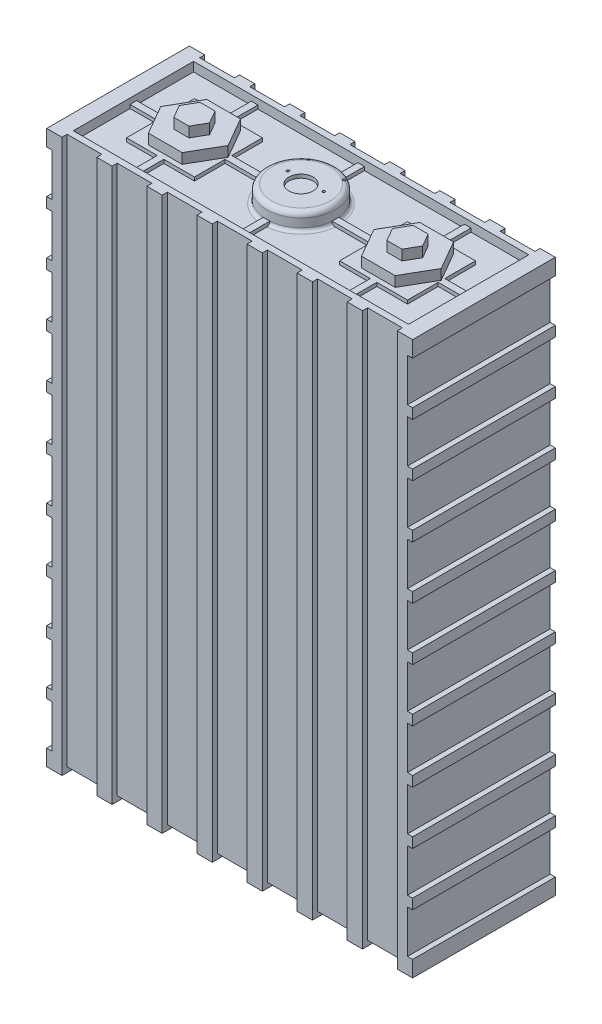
from build123d import *

# Parameters (mm, degrees)
SKETCH1_W           = 182
SKETCH1_H           = 275
BOSS_EXTRUDE1_DEPTH = 71
SKETCH2_W           = 71
SKETCH2_H           = 21.328
CUT_EXTRUDE1_DEPTH  = 2.54
SKETCH3_W           = 17.291428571
SKETCH3_H           = 275
SKETCH3_W_2         = 17.291428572
CUT_EXTRUDE2_DEPTH  = 2.54
SKETCH5_W           = 17.291428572
SKETCH5_H           = 65.92
SKETCH5_W_2         = 17.291428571
CUT_EXTRUDE3_DEPTH  = 2.54
SKETCH7_W           = 166.76
SKETCH7_H           = 59.824
CUT_EXTRUDE4_DEPTH  = 4.572
BOSS_EXTRUDE5_DEPTH = 1.778
SKETCH10_R          = 17.145
BOSS_EXTRUDE6_DEPTH = 8.382
FILLET2_R           = 2.54
FILLET4_R           = 1.6256
SKETCH11_R          = 6.023369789
CUT_EXTRUDE5_DEPTH  = 1.778
SKETCH12_R          = 0.648251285
CUT_EXTRUDE6_DEPTH  = 1.27
BOSS_EXTRUDE7_DEPTH = 5.08
BOSS_EXTRUDE8_DEPTH = 5.08


with BuildPart() as part:
    # Sketch1 → Boss-Extrude1 (new body)
    with BuildSketch(Plane.XY):
        with Locations((-91, 137.5)):
            Rectangle(SKETCH1_W, SKETCH1_H)
    extrude(amount=BOSS_EXTRUDE1_DEPTH)

    # Sketch2 → Cut-Extrude1 (cut)
    with BuildSketch(Plane.ZY.offset(182)):
        with Locations((35.5, 256.336)):
            Rectangle(SKETCH2_W, SKETCH2_H)
        with Locations((35.5, 229.928)):
            Rectangle(SKETCH2_W, SKETCH2_H)
        with Locations((35.5, 203.52)):
            Rectangle(SKETCH2_W, SKETCH2_H)
        with Locations((35.5, 177.112)):
            Rectangle(SKETCH2_W, SKETCH2_H)
        with Locations((35.5, 150.704)):
            Rectangle(SKETCH2_W, SKETCH2_H)
        with Locations((35.5, 124.296)):
            Rectangle(SKETCH2_W, SKETCH2_H)
        with Locations((35.5, 97.888)):
            Rectangle(SKETCH2_W, SKETCH2_H)
        with Locations((35.5, 71.48)):
            Rectangle(SKETCH2_W, SKETCH2_H)
        with Locations((35.5, 45.072)):
            Rectangle(SKETCH2_W, SKETCH2_H)
        with Locations((35.5, 18.664)):
            Rectangle(SKETCH2_W, SKETCH2_H)
    cut_extrude1 = extrude(amount=-CUT_EXTRUDE1_DEPTH, mode=Mode.SUBTRACT)

    # Mirror1: Cut-Extrude1 across plane
    add(cut_extrude1.mirror(Plane(origin=(-91, 0, 0), x_dir=(0, 0, 1), z_dir=(1, 0, 0))), mode=Mode.SUBTRACT)

    # Sketch3 → Cut-Extrude2 (cut)
    with BuildSketch(Plane.XY.offset(71)):
        with Locations((-165.734285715, 137.5)):
            Rectangle(SKETCH3_W, SKETCH3_H)
        with Locations((-140.822857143, 137.5)):
            Rectangle(SKETCH3_W_2, SKETCH3_H)
        with Locations((-115.911428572, 137.5)):
            Rectangle(SKETCH3_W, SKETCH3_H)
        with Locations((-91, 137.5)):
            Rectangle(SKETCH3_W_2, SKETCH3_H)
        with Locations((-66.088571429, 137.5)):
            Rectangle(SKETCH3_W, SKETCH3_H)
        with Locations((-41.177142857, 137.5)):
            Rectangle(SKETCH3_W_2, SKETCH3_H)
        with Locations((-16.265714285, 137.5)):
            Rectangle(SKETCH3_W, SKETCH3_H)
    cut_extrude2 = extrude(amount=-CUT_EXTRUDE2_DEPTH, mode=Mode.SUBTRACT)

    # Mirror2: Cut-Extrude2 across plane
    add(cut_extrude2.mirror(Plane.XY.offset(35.5)), mode=Mode.SUBTRACT)

    # Sketch5 → Cut-Extrude3 (cut)
    with BuildSketch(Plane.XZ):
        with Locations((-140.822857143, 35.5)):
            Rectangle(SKETCH5_W, SKETCH5_H)
        with Locations((-165.734285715, 35.5)):
            Rectangle(SKETCH5_W_2, SKETCH5_H)
        with Locations((-115.911428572, 35.5)):
            Rectangle(SKETCH5_W_2, SKETCH5_H)
        with Locations((-91, 35.5)):
            Rectangle(SKETCH5_W, SKETCH5_H)
        with Locations((-66.088571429, 35.5)):
            Rectangle(SKETCH5_W_2, SKETCH5_H)
        with Locations((-41.177142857, 35.5)):
            Rectangle(SKETCH5_W, SKETCH5_H)
        with Locations((-16.265714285, 35.5)):
            Rectangle(SKETCH5_W_2, SKETCH5_H)
    extrude(amount=-CUT_EXTRUDE3_DEPTH, mode=Mode.SUBTRACT)

    # Sketch7 → Cut-Extrude4 (cut)
    with BuildSketch(Plane(origin=(0, 275, 0), x_dir=(1, 0, 0), z_dir=(0, 1, 0))):
        with Locations((-91, -35.5)):
            Rectangle(SKETCH7_W, SKETCH7_H)
    extrude(amount=-CUT_EXTRUDE4_DEPTH, mode=Mode.SUBTRACT)

    # Sketch8 → Boss-Extrude5 (add)
    with BuildSketch(Plane(origin=(0, 270.428, 0), x_dir=(1, 0, 0), z_dir=(0, 1, 0))):
        Polygon((-142.349, -18.609), (-127.109, -18.609), (-127.109, -33.849), (-92.651, -33.849), (-92.651, -5.588), (-89.349, -5.588), (-89.349, -33.849), (-54.891, -33.849), (-54.891, -18.609), (-39.651, -18.609), (-39.651, -5.588), (-36.349, -5.588), (-36.349, -18.609), (-21.109, -18.609), (-21.109, -33.849), (-7.62, -33.849), (-7.62, -37.151), (-21.109, -37.151), (-21.109, -52.391), (-36.349, -52.391), (-36.349, -65.412), (-39.651, -65.412), (-39.651, -52.391), (-54.891, -52.391), (-54.891, -37.151), (-89.349, -37.151), (-89.349, -65.412), (-92.651, -65.412), (-92.651, -37.151), (-127.109, -37.151), (-127.109, -52.391), (-142.349, -52.391), (-142.349, -65.412), (-145.651, -65.412), (-145.651, -52.391), (-160.891, -52.391), (-160.891, -37.151), (-174.38, -37.151), (-174.38, -33.849), (-160.891, -33.849), (-160.891, -18.609), (-145.651, -18.609), (-145.651, -5.588), (-142.349, -5.588), align=None)
    extrude(amount=BOSS_EXTRUDE5_DEPTH)

    # Sketch10 → Boss-Extrude6 (add)
    with BuildSketch(Plane(origin=(0, 270.428, 0), x_dir=(-1, 0, 0), z_dir=(0, 1, 0))):
        with Locations(Location((91, 35.5, 0), (0, 0, 264.474065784))):
            Circle(SKETCH10_R)
    extrude(amount=BOSS_EXTRUDE6_DEPTH)

    # Fillet2
    fillet2_edges = [part.edges().sort_by_distance(p)[0] for p in [
        (-92.651, 278.81, 52.565322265),
    ]]
    fillet(fillet2_edges, radius=FILLET2_R)

    # Fillet4
    fillet4_edges = [part.edges().sort_by_distance(p)[0] for p in [
        (-103.123345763, 270.428, 47.623345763),
        (-78.876654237, 270.428, 47.623345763),
        (-78.876654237, 270.428, 23.376654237),
        (-103.123345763, 270.428, 23.376654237),
    ]]
    fillet(fillet4_edges, radius=FILLET4_R)

    # Sketch11 → Cut-Extrude5 (cut)
    with BuildSketch(Plane(origin=(0, 278.81, 0), x_dir=(1, 0, 0), z_dir=(0, 1, 0))):
        with Locations(Location((-91, -35.5, 0), (0, 0, 270))):
            Circle(SKETCH11_R)
    extrude(amount=-CUT_EXTRUDE5_DEPTH, mode=Mode.SUBTRACT)

    # Sketch12 → Cut-Extrude6 (cut)
    with BuildSketch(Plane(origin=(0, 278.81, 0), x_dir=(1, 0, 0), z_dir=(0, 1, 0))):
        with Locations((-91, -38.230173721)):
            Circle(SKETCH12_R)
        with Locations(Location((-99.859590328, -33.115086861, 0), (0, 0, 270))):
            Circle(SKETCH12_R)
        with Locations(Location((-99.859590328, -22.884913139, 0), (0, 0, 270))):
            Circle(SKETCH12_R)
        with Locations((-91, -17.769826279)):
            Circle(SKETCH12_R)
        with Locations(Location((-82.140409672, -22.884913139, 0), (0, 0, 270))):
            Circle(SKETCH12_R)
        with Locations(Location((-82.140409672, -33.115086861, 0), (0, 0, 270))):
            Circle(SKETCH12_R)
    extrude(amount=-CUT_EXTRUDE6_DEPTH, mode=Mode.SUBTRACT)

    # Sketch13 → Boss-Extrude7 (add)
    with BuildSketch(Plane(origin=(0, 272.206, 0), x_dir=(1, 0, 0), z_dir=(0, 1, 0))):
        Polygon((-127.236, -35.5), (-135.618, -20.981950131), (-152.382, -20.981950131), (-160.764, -35.5), (-152.382, -50.018049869), (-135.618, -50.018049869), align=None)
        Polygon((-21.236, -35.5), (-29.618, -20.981950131), (-46.382, -20.981950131), (-54.764, -35.5), (-46.382, -50.018049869), (-29.618, -50.018049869), align=None)
    extrude(amount=BOSS_EXTRUDE7_DEPTH)

    # Sketch14 → Boss-Extrude8 (add)
    with BuildSketch(Plane(origin=(0, 277.286, 0), x_dir=(1, 0, 0), z_dir=(0, 1, 0))):
        Polygon((-136.494446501, -35.5), (-140.24722325, -29), (-147.75277675, -29), (-151.505553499, -35.5), (-147.75277675, -42), (-140.24722325, -42), align=None)
        Polygon((-30.494446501, -35.5), (-34.24722325, -29), (-41.75277675, -29), (-45.505553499, -35.5), (-41.75277675, -42), (-34.24722325, -42), align=None)
    extrude(amount=BOSS_EXTRUDE8_DEPTH)


solid = part.part
